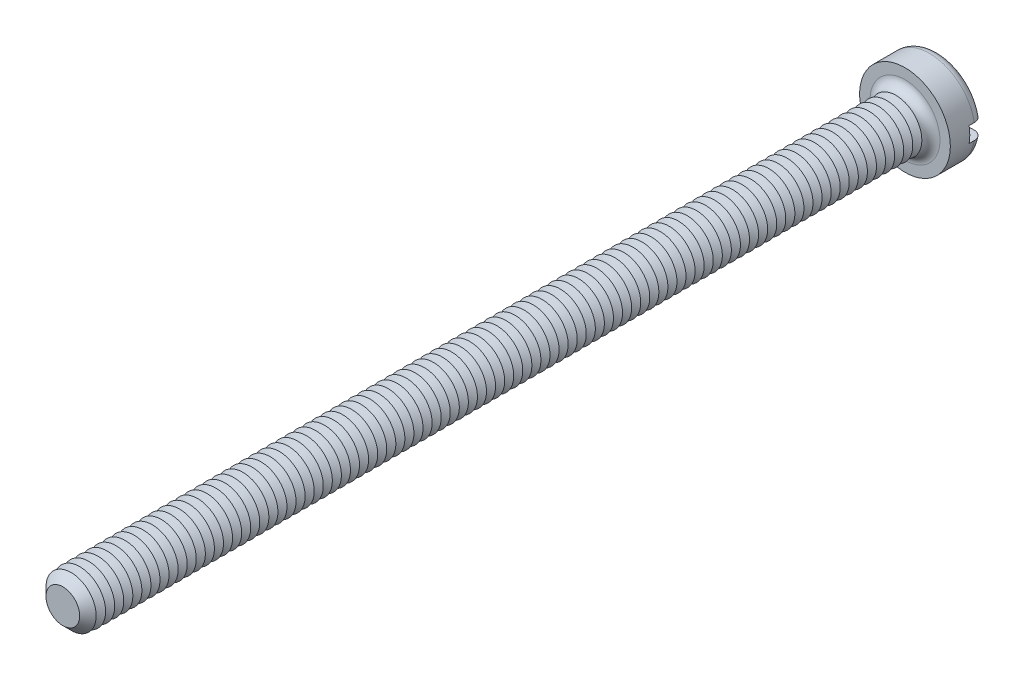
from build123d import *

# Parameters (mm, degrees)
SKETCH3_R           = 3.5
BOSS_EXTRUDE2_DEPTH = 2.6
SKETCH4_R           = 2
BOSS_EXTRUDE3_DEPTH = 65
FILLET1_R           = 0.7
CHAMFER1_SIZE       = 0.7
LPATTERN1_COUNT     = 91
LPATTERN1_PITCH     = 0.7
SKETCH8_W           = 7
SKETCH8_H           = 1.2
CUT_EXTRUDE1_DEPTH  = 1.1


with BuildPart() as part:
    # Sketch3 → Boss-Extrude2 (new body)
    with BuildSketch(Plane.XY):
        Circle(SKETCH3_R)
    extrude(amount=-BOSS_EXTRUDE2_DEPTH)

    # Sketch4 → Boss-Extrude3 (add)
    with BuildSketch(Plane.XY):
        Circle(SKETCH4_R)
    extrude(amount=BOSS_EXTRUDE3_DEPTH)

    # Fillet1
    fillet1_edges = [part.edges().sort_by_distance(p)[0] for p in [
        (-3.5, 0, -2.6),
        (-2, 0, 0),
    ]]
    fillet(fillet1_edges, radius=FILLET1_R)

    # Chamfer1
    chamfer1_edges = [part.edges().sort_by_distance(p)[0] for p in [
        (-2, 0, 65),
    ]]
    chamfer(chamfer1_edges, length=CHAMFER1_SIZE)

    # Sketch6 → Cut-Revolve1 (revolve, cut)
    with BuildSketch(Plane(origin=(0, 0, 0), x_dir=(0, 0, -1), z_dir=(1, 0, 0)), mode=Mode.PRIVATE) as cut_revolve1_sk:
        Polygon((-0.7, 2), (-1.05, 1.393782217), (-1.4, 2), align=None)
    cut_revolve1 = revolve(cut_revolve1_sk.sketch.rotate(Axis((0, 0, -1.694361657), (0, 0, 1)), 90), axis=Axis((0, 0, -1.694361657), (0, 0, 1)), mode=Mode.SUBTRACT)

    # LPattern1: Cut-Revolve1 ×91
    with Locations(*[(0, 0, i * LPATTERN1_PITCH) for i in range(1, LPATTERN1_COUNT)]):
        add(cut_revolve1, mode=Mode.SUBTRACT)

    # Sketch8 → Cut-Extrude1 (cut)
    with BuildSketch(Plane(origin=(0, 0, -2.6), x_dir=(-1, 0, 0), z_dir=(0, 0, -1))):
        Rectangle(SKETCH8_W, SKETCH8_H)
    extrude(amount=-CUT_EXTRUDE1_DEPTH, mode=Mode.SUBTRACT)


solid = part.part
